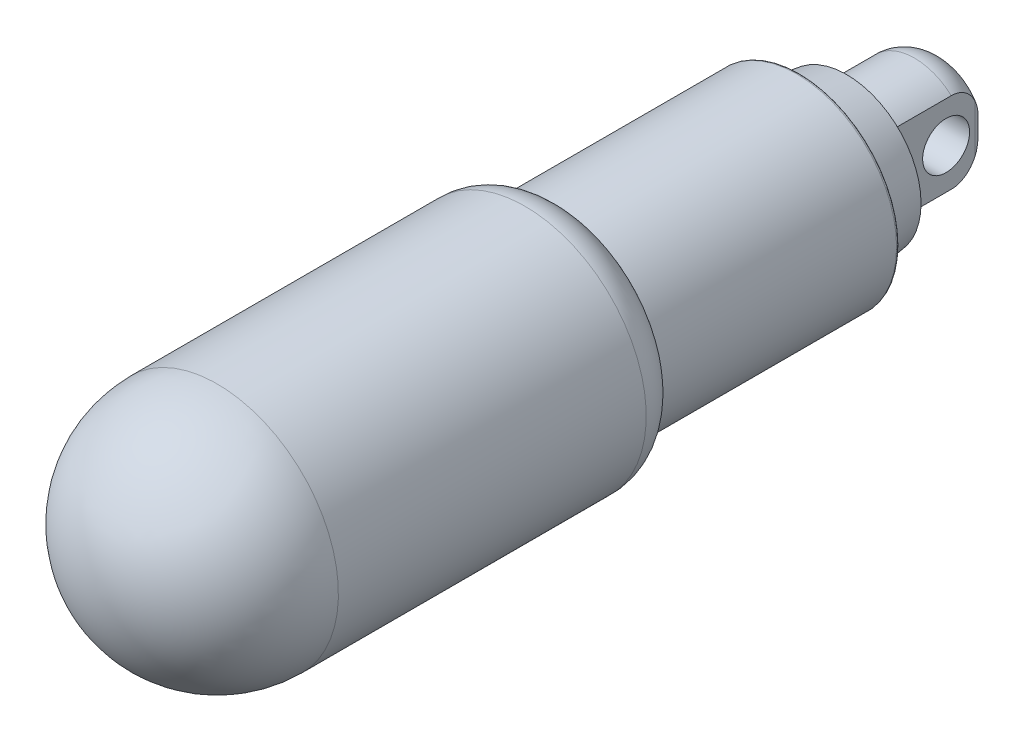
ISO-10303-21;
HEADER;
FILE_DESCRIPTION(('STEP AP214'),'2;1');
FILE_NAME('part.step','',(''),(''),'','','');
FILE_SCHEMA(('AUTOMOTIVE_DESIGN { 1 0 10303 214 1 1 1 1 }'));
ENDSEC;
DATA;
#1=APPLICATION_CONTEXT('core data for automotive mechanical design processes');
#2=APPLICATION_PROTOCOL_DEFINITION('international standard','automotive_design',2000,#1);
#3=PRODUCT_CONTEXT('',#1,'mechanical');
#4=PRODUCT('Part','Part','',(#3));
#5=PRODUCT_RELATED_PRODUCT_CATEGORY('part','',(#4));
#6=PRODUCT_DEFINITION_FORMATION('','',#4);
#7=PRODUCT_DEFINITION_CONTEXT('part definition',#1,'design');
#8=PRODUCT_DEFINITION('design','',#6,#7);
#9=PRODUCT_DEFINITION_SHAPE('','',#8);
#10=(LENGTH_UNIT() NAMED_UNIT(*) SI_UNIT(.MILLI.,.METRE.));
#11=(NAMED_UNIT(*) PLANE_ANGLE_UNIT() SI_UNIT($,.RADIAN.));
#12=(NAMED_UNIT(*) SI_UNIT($,.STERADIAN.) SOLID_ANGLE_UNIT());
#13=UNCERTAINTY_MEASURE_WITH_UNIT(LENGTH_MEASURE(1.E-05),#10,'distance_accuracy_value','');
#14=(GEOMETRIC_REPRESENTATION_CONTEXT(3) GLOBAL_UNCERTAINTY_ASSIGNED_CONTEXT((#13)) GLOBAL_UNIT_ASSIGNED_CONTEXT((#10,
#11,#12)) REPRESENTATION_CONTEXT('',''));
#15=CARTESIAN_POINT('',(0.,0.,0.));
#16=DIRECTION('',(0.,0.,1.));
#17=DIRECTION('',(1.,0.,0.));
#18=AXIS2_PLACEMENT_3D('',#15,#16,#17);
#19=CARTESIAN_POINT('',(0.,0.75,-2.3333333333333));
#20=DIRECTION('',(0.,0.,-1.));
#21=DIRECTION('',(0.,1.,0.));
#22=AXIS2_PLACEMENT_3D('',#19,#20,#21);
#23=PLANE('',#22);
#24=CARTESIAN_POINT('',(0.,0.,-2.3333333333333));
#25=DIRECTION('',(0.,0.,1.));
#26=DIRECTION('',(1.,0.,0.));
#27=AXIS2_PLACEMENT_3D('',#24,#25,#26);
#28=CIRCLE('',#27,1.5);
#29=CARTESIAN_POINT('',(1.5,0.,-2.3333333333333));
#30=VERTEX_POINT('',#29);
#31=CARTESIAN_POINT('',(0.,1.5,-2.3333333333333));
#32=VERTEX_POINT('',#31);
#33=EDGE_CURVE('E186',#30,#32,#28,.T.);
#34=ORIENTED_EDGE('',*,*,#33,.F.);
#35=CARTESIAN_POINT('',(0.,0.,-2.3333333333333));
#36=DIRECTION('',(0.,0.,1.));
#37=DIRECTION('',(-1.,0.,0.));
#38=AXIS2_PLACEMENT_3D('',#35,#36,#37);
#39=CIRCLE('',#38,1.5);
#40=CARTESIAN_POINT('',(-1.5,0.,-2.3333333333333));
#41=VERTEX_POINT('',#40);
#42=EDGE_CURVE('E81',#41,#30,#39,.T.);
#43=ORIENTED_EDGE('',*,*,#42,.F.);
#44=CARTESIAN_POINT('',(0.,0.,-2.3333333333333));
#45=DIRECTION('',(0.,0.,1.));
#46=DIRECTION('',(0.,1.,0.));
#47=AXIS2_PLACEMENT_3D('',#44,#45,#46);
#48=CIRCLE('',#47,1.49999999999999);
#49=EDGE_CURVE('E182',#32,#41,#48,.T.);
#50=ORIENTED_EDGE('',*,*,#49,.F.);
#51=EDGE_LOOP('',(#34,#43,#50));
#52=FACE_BOUND('',#51,.T.);
#53=ADVANCED_FACE('F14',(#52),#23,.T.);
#54=CARTESIAN_POINT('',(-1.85,-7.75,-1.8333333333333));
#55=DIRECTION('',(0.,-1.,0.));
#56=DIRECTION('',(1.,0.,0.));
#57=AXIS2_PLACEMENT_3D('',#54,#55,#56);
#58=CYLINDRICAL_SURFACE('',#57,0.5);
#59=DIRECTION('',(0.,1.,0.));
#60=VECTOR('',#59,1.);
#61=CARTESIAN_POINT('',(-2.35,-7.75,-1.8333333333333));
#62=LINE('',#61,#60);
#63=CARTESIAN_POINT('',(-2.35,-1.5640098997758,-1.8333333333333));
#64=VERTEX_POINT('',#63);
#65=CARTESIAN_POINT('',(-2.35,1.56400989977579,-1.8333333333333));
#66=VERTEX_POINT('',#65);
#67=EDGE_CURVE('E112',#64,#66,#62,.T.);
#68=ORIENTED_EDGE('',*,*,#67,.T.);
#69=CARTESIAN_POINT('',(-2.35,-1.5640098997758,-1.8333333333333));
#70=CARTESIAN_POINT('',(-2.35000059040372,-1.52921617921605,-1.85033683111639));
#71=CARTESIAN_POINT('',(-2.34913273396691,-1.49426464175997,-1.86699499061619));
#72=CARTESIAN_POINT('',(-2.3458742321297,-1.42405953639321,-1.89947718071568));
#73=CARTESIAN_POINT('',(-2.34348409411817,-1.38880607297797,-1.91530148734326));
#74=CARTESIAN_POINT('',(-2.33436002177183,-1.28269217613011,-1.96127595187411));
#75=CARTESIAN_POINT('',(-2.32567104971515,-1.21136632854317,-1.98998321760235));
#76=CARTESIAN_POINT('',(-2.30491634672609,-1.06739492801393,-2.04275325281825));
#77=CARTESIAN_POINT('',(-2.29284515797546,-0.994747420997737,-2.06680840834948));
#78=CARTESIAN_POINT('',(-2.26741048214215,-0.848150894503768,-2.10972121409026));
#79=CARTESIAN_POINT('',(-2.25404704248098,-0.774201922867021,-2.1285790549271));
#80=CARTESIAN_POINT('',(-2.23371793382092,-0.656205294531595,-2.15412271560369));
#81=CARTESIAN_POINT('',(-2.22641554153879,-0.612597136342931,-2.16259953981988));
#82=CARTESIAN_POINT('',(-2.21262642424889,-0.524936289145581,-2.17772651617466));
#83=CARTESIAN_POINT('',(-2.20613963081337,-0.480883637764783,-2.18437682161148));
#84=CARTESIAN_POINT('',(-2.1944499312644,-0.39247721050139,-2.1958543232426));
#85=CARTESIAN_POINT('',(-2.18924403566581,-0.34812438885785,-2.20068577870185));
#86=CARTESIAN_POINT('',(-2.18049591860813,-0.259099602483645,-2.2085766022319));
#87=CARTESIAN_POINT('',(-2.1769534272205,-0.21442769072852,-2.21163625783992));
#88=CARTESIAN_POINT('',(-2.17276895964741,-0.141431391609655,-2.21520313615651));
#89=CARTESIAN_POINT('',(-2.17153891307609,-0.113164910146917,-2.21623573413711));
#90=CARTESIAN_POINT('',(-2.16989218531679,-0.0566002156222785,-2.21761158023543));
#91=CARTESIAN_POINT('',(-2.16947528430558,-0.0283020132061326,-2.2179550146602));
#92=CARTESIAN_POINT('',(-2.16948364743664,0.0682596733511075,-2.21795563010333));
#93=CARTESIAN_POINT('',(-2.17192890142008,0.136541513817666,-2.2159593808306));
#94=CARTESIAN_POINT('',(-2.1812385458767,0.272585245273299,-2.20792078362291));
#95=CARTESIAN_POINT('',(-2.18810618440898,0.340346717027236,-2.20187546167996));
#96=CARTESIAN_POINT('',(-2.20504645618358,0.475336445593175,-2.18558202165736));
#97=CARTESIAN_POINT('',(-2.21513705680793,0.542559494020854,-2.17531024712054));
#98=CARTESIAN_POINT('',(-2.23687971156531,0.675941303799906,-2.15050039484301));
#99=CARTESIAN_POINT('',(-2.24853171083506,0.742100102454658,-2.1359624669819));
#100=CARTESIAN_POINT('',(-2.27165531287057,0.872912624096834,-2.10279970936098));
#101=CARTESIAN_POINT('',(-2.28312760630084,0.937573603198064,-2.08420392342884));
#102=CARTESIAN_POINT('',(-2.30445804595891,1.06589445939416,-2.04310545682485));
#103=CARTESIAN_POINT('',(-2.31431668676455,1.12955463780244,-2.02060397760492));
#104=CARTESIAN_POINT('',(-2.3309893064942,1.25551542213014,-1.97224765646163));
#105=CARTESIAN_POINT('',(-2.33782319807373,1.31782227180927,-1.94641623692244));
#106=CARTESIAN_POINT('',(-2.34733950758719,1.44158364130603,-1.89187345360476));
#107=CARTESIAN_POINT('',(-2.35001595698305,1.50303681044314,-1.86315801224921));
#108=CARTESIAN_POINT('',(-2.35,1.56400989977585,-1.8333333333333));
#109=B_SPLINE_CURVE_WITH_KNOTS('',3,(#69,#70,#71,#72,#73,#74,#75,#76,#77,#78,#79,#80,#81,#82,
#83,#84,#85,#86,#87,#88,#89,#90,#91,#92,#93,#94,#95,#96,#97,#98,#99,#100,#101,#102,#103,#104,
#105,#106,#107,#108),.UNSPECIFIED.,.F.,.F.,(4,2,2,2,2,2,2,2,2,2,2,2,2,2,2,2,2,2,2,4),(0.,
0.116151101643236,0.232263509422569,0.464114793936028,0.696342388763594,0.928561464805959,
1.06358517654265,1.19859755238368,1.33329176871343,1.46796412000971,1.55288110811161,
1.63777513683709,1.84252518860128,2.04742579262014,2.25348922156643,2.45954541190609,
2.66417250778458,2.8687367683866,3.0719335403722,3.27542175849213),.UNSPECIFIED.);
#110=EDGE_CURVE('E80',#64,#66,#109,.T.);
#111=ORIENTED_EDGE('',*,*,#110,.F.);
#112=EDGE_LOOP('',(#68,#111));
#113=FACE_BOUND('',#112,.T.);
#114=ADVANCED_FACE('F227',(#113),#58,.T.);
#115=CARTESIAN_POINT('',(7.75,0.,0.));
#116=DIRECTION('',(1.,0.,0.));
#117=DIRECTION('',(0.,1.,0.));
#118=AXIS2_PLACEMENT_3D('',#115,#116,#117);
#119=CYLINDRICAL_SURFACE('',#118,1.5);
#120=CARTESIAN_POINT('',(2.35,0.,0.));
#121=DIRECTION('',(1.,0.,0.));
#122=DIRECTION('',(0.,1.,0.));
#123=AXIS2_PLACEMENT_3D('',#120,#121,#122);
#124=CIRCLE('',#123,1.5);
#125=CARTESIAN_POINT('',(2.35,1.5,0.));
#126=VERTEX_POINT('',#125);
#127=EDGE_CURVE('E92',#126,#126,#124,.T.);
#128=ORIENTED_EDGE('',*,*,#127,.T.);
#129=EDGE_LOOP('',(#128));
#130=FACE_BOUND('',#129,.T.);
#131=CARTESIAN_POINT('',(-2.35,0.,0.));
#132=DIRECTION('',(1.,0.,0.));
#133=DIRECTION('',(0.,1.,0.));
#134=AXIS2_PLACEMENT_3D('',#131,#132,#133);
#135=CIRCLE('',#134,1.5);
#136=CARTESIAN_POINT('',(-2.35,1.5,0.));
#137=VERTEX_POINT('',#136);
#138=EDGE_CURVE('E218',#137,#137,#135,.F.);
#139=ORIENTED_EDGE('',*,*,#138,.T.);
#140=EDGE_LOOP('',(#139));
#141=FACE_BOUND('',#140,.T.);
#142=ADVANCED_FACE('F241',(#130,#141),#119,.F.);
#143=CARTESIAN_POINT('',(1.85,-7.75,-1.8333333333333));
#144=DIRECTION('',(0.,-1.,0.));
#145=DIRECTION('',(1.,0.,0.));
#146=AXIS2_PLACEMENT_3D('',#143,#144,#145);
#147=CYLINDRICAL_SURFACE('',#146,0.5);
#148=DIRECTION('',(0.,1.,0.));
#149=VECTOR('',#148,1.);
#150=CARTESIAN_POINT('',(2.35,-7.75,-1.8333333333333));
#151=LINE('',#150,#149);
#152=CARTESIAN_POINT('',(2.35,1.5640098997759,-1.8333333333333));
#153=VERTEX_POINT('',#152);
#154=CARTESIAN_POINT('',(2.35,-1.5640098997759,-1.8333333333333));
#155=VERTEX_POINT('',#154);
#156=EDGE_CURVE('E77',#153,#155,#151,.F.);
#157=ORIENTED_EDGE('',*,*,#156,.T.);
#158=CARTESIAN_POINT('',(2.35,1.5640098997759,-1.8333333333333));
#159=CARTESIAN_POINT('',(2.35000059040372,1.52921617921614,-1.85033683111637));
#160=CARTESIAN_POINT('',(2.34913273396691,1.49426464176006,-1.86699499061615));
#161=CARTESIAN_POINT('',(2.34587423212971,1.4240595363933,-1.89947718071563));
#162=CARTESIAN_POINT('',(2.34348409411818,1.38880607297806,-1.91530148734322));
#163=CARTESIAN_POINT('',(2.33436002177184,1.2826921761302,-1.96127595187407));
#164=CARTESIAN_POINT('',(2.32567104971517,1.21136632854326,-1.98998321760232));
#165=CARTESIAN_POINT('',(2.3049163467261,1.06739492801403,-2.04275325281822));
#166=CARTESIAN_POINT('',(2.29284515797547,0.994747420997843,-2.06680840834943));
#167=CARTESIAN_POINT('',(2.26741048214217,0.848150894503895,-2.10972121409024));
#168=CARTESIAN_POINT('',(2.254047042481,0.774201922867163,-2.12857905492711));
#169=CARTESIAN_POINT('',(2.23371793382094,0.656205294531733,-2.15412271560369));
#170=CARTESIAN_POINT('',(2.22641554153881,0.612597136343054,-2.16259953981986));
#171=CARTESIAN_POINT('',(2.21262642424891,0.52493628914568,-2.17772651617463));
#172=CARTESIAN_POINT('',(2.20613963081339,0.480883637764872,-2.18437682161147));
#173=CARTESIAN_POINT('',(2.19444993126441,0.392477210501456,-2.19585432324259));
#174=CARTESIAN_POINT('',(2.18924403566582,0.348124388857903,-2.20068577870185));
#175=CARTESIAN_POINT('',(2.18049591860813,0.259099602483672,-2.2085766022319));
#176=CARTESIAN_POINT('',(2.1769534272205,0.214427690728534,-2.21163625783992));
#177=CARTESIAN_POINT('',(2.17276895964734,0.141431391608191,-2.21520313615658));
#178=CARTESIAN_POINT('',(2.17153891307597,0.113164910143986,-2.21623573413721));
#179=CARTESIAN_POINT('',(2.16989218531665,0.0566002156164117,-2.21761158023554));
#180=CARTESIAN_POINT('',(2.16947528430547,0.0283020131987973,-2.21795501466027));
#181=CARTESIAN_POINT('',(2.16948364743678,-0.0682596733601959,-2.21795563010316));
#182=CARTESIAN_POINT('',(2.1719289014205,-0.136541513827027,-2.21595938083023));
#183=CARTESIAN_POINT('',(2.1812385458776,-0.272585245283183,-2.20792078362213));
#184=CARTESIAN_POINT('',(2.18810618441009,-0.34034671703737,-2.20187546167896));
#185=CARTESIAN_POINT('',(2.20504645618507,-0.475336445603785,-2.18558202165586));
#186=CARTESIAN_POINT('',(2.2151370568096,-0.54255949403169,-2.17531024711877));
#187=CARTESIAN_POINT('',(2.23687971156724,-0.675941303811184,-2.15050039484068));
#188=CARTESIAN_POINT('',(2.24853171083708,-0.742100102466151,-2.13596246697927));
#189=CARTESIAN_POINT('',(2.27165531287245,-0.872912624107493,-2.10279970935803));
#190=CARTESIAN_POINT('',(2.28312760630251,-0.937573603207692,-2.08420392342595));
#191=CARTESIAN_POINT('',(2.30445804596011,-1.06589445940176,-2.04310545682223));
#192=CARTESIAN_POINT('',(2.31431668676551,-1.12955463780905,-2.02060397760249));
#193=CARTESIAN_POINT('',(2.33098930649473,-1.25551542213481,-1.97224765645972));
#194=CARTESIAN_POINT('',(2.33782319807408,-1.31782227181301,-1.94641623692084));
#195=CARTESIAN_POINT('',(2.34733950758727,-1.44158364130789,-1.89187345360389));
#196=CARTESIAN_POINT('',(2.35001595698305,-1.50303681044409,-1.86315801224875));
#197=CARTESIAN_POINT('',(2.35,-1.5640098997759,-1.8333333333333));
#198=B_SPLINE_CURVE_WITH_KNOTS('',3,(#158,#159,#160,#161,#162,#163,#164,#165,#166,#167,#168,
#169,#170,#171,#172,#173,#174,#175,#176,#177,#178,#179,#180,#181,#182,#183,#184,#185,#186,#187,
#188,#189,#190,#191,#192,#193,#194,#195,#196,#197),.UNSPECIFIED.,.F.,.F.,(4,2,2,2,2,2,2,2,2,2,2,
2,2,2,2,2,2,2,2,4),(0.,0.11615110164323,0.232263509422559,0.464114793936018,0.696342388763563,
0.928561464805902,1.06358517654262,1.19859755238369,1.33329176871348,1.46796412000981,
1.5528811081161,1.63777513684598,1.84252518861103,2.04742579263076,2.25348922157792,
2.45954541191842,2.66417250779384,2.86873676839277,3.07193354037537,3.27542175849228),.UNSPECIFIED.);
#199=EDGE_CURVE('E73',#153,#155,#198,.T.);
#200=ORIENTED_EDGE('',*,*,#199,.F.);
#201=EDGE_LOOP('',(#157,#200));
#202=FACE_BOUND('',#201,.T.);
#203=ADVANCED_FACE('F75',(#202),#147,.T.);
#204=CARTESIAN_POINT('',(-1.5,0.,-0.3333333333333));
#205=DIRECTION('',(0.,-1.,0.));
#206=DIRECTION('',(-1.,0.,0.));
#207=AXIS2_PLACEMENT_3D('',#204,#205,#206);
#208=CIRCLE('',#207,2.);
#209=TRIMMED_CURVE('',#208,(PARAMETER_VALUE(-2.41885840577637)),
(PARAMETER_VALUE(2.41885840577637)),.T.,.PARAMETER.);
#210=CARTESIAN_POINT('',(0.,0.,-0.3333333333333));
#211=DIRECTION('',(0.,0.,1.));
#212=AXIS1_PLACEMENT('',#210,#211);
#213=SURFACE_OF_REVOLUTION('',#209,#212);
#214=ORIENTED_EDGE('',*,*,#49,.T.);
#215=ORIENTED_EDGE('',*,*,#42,.T.);
#216=ORIENTED_EDGE('',*,*,#33,.T.);
#217=EDGE_LOOP('',(#214,#215,#216));
#218=FACE_BOUND('',#217,.T.);
#219=CARTESIAN_POINT('',(-2.35,-2.5937424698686,-0.3333333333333));
#220=CARTESIAN_POINT('',(-2.35,-2.59375045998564,-0.377182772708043));
#221=CARTESIAN_POINT('',(-2.35,-2.59179672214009,-0.421028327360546));
#222=CARTESIAN_POINT('',(-2.35,-2.58402697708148,-0.508363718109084));
#223=CARTESIAN_POINT('',(-2.35,-2.57821207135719,-0.551853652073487));
#224=CARTESIAN_POINT('',(-2.35,-2.56281070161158,-0.637989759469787));
#225=CARTESIAN_POINT('',(-2.35,-2.55323878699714,-0.680638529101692));
#226=CARTESIAN_POINT('',(-2.35,-2.53044831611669,-0.764938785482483));
#227=CARTESIAN_POINT('',(-2.35,-2.51722965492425,-0.806590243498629));
#228=CARTESIAN_POINT('',(-2.35,-2.47233422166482,-0.929550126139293));
#229=CARTESIAN_POINT('',(-2.35,-2.43539328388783,-1.00899955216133));
#230=CARTESIAN_POINT('',(-2.35,-2.34912359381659,-1.16079487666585));
#231=CARTESIAN_POINT('',(-2.35,-2.2997896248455,-1.2331377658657));
#232=CARTESIAN_POINT('',(-2.35,-2.18890735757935,-1.3716343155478));
#233=CARTESIAN_POINT('',(-2.35,-2.12701431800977,-1.43751055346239));
#234=CARTESIAN_POINT('',(-2.35,-1.99429539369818,-1.55958499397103));
#235=CARTESIAN_POINT('',(-2.35,-1.92346279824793,-1.61577585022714));
#236=CARTESIAN_POINT('',(-2.35,-1.80388642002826,-1.69841652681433));
#237=CARTESIAN_POINT('',(-2.35,-1.75722498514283,-1.72795114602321));
#238=CARTESIAN_POINT('',(-2.35,-1.66198564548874,-1.78333397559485));
#239=CARTESIAN_POINT('',(-2.35,-1.6134153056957,-1.80919516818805));
#240=CARTESIAN_POINT('',(-2.35,-1.5640098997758,-1.8333333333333));
#241=B_SPLINE_CURVE_WITH_KNOTS('',3,(#219,#220,#221,#222,#223,#224,#225,#226,#227,#228,#229,
#230,#231,#232,#233,#234,#235,#236,#237,#238,#239,#240),.UNSPECIFIED.,.F.,.F.,(4,2,2,2,2,2,2,2,
2,2,4),(0.,0.131498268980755,0.262959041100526,0.393915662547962,0.524876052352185,
0.786389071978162,1.04801235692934,1.3181350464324,1.58846173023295,1.75398900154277,
1.91891589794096),.UNSPECIFIED.);
#242=CARTESIAN_POINT('',(-2.35,-2.5937424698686,-0.3333333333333));
#243=VERTEX_POINT('',#242);
#244=EDGE_CURVE('E115',#243,#64,#241,.T.);
#245=ORIENTED_EDGE('',*,*,#244,.T.);
#246=ORIENTED_EDGE('',*,*,#110,.T.);
#247=CARTESIAN_POINT('',(-2.35,1.56400989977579,-1.8333333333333));
#248=CARTESIAN_POINT('',(-2.34999999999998,1.61224710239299,-1.80976387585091));
#249=CARTESIAN_POINT('',(-2.34999999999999,1.65968111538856,-1.78455890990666));
#250=CARTESIAN_POINT('',(-2.35000000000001,1.75263202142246,-1.73072923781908));
#251=CARTESIAN_POINT('',(-2.35000000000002,1.798146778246,-1.70210085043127));
#252=CARTESIAN_POINT('',(-2.34999999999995,1.93182221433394,-1.61050564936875));
#253=CARTESIAN_POINT('',(-2.34999999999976,2.01641491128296,-1.5421614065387));
#254=CARTESIAN_POINT('',(-2.34999999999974,2.17273088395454,-1.39094225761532));
#255=CARTESIAN_POINT('',(-2.34999999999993,2.24436939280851,-1.30797819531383));
#256=CARTESIAN_POINT('',(-2.35000000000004,2.33849905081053,-1.17446663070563));
#257=CARTESIAN_POINT('',(-2.35000000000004,2.36762858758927,-1.12850944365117));
#258=CARTESIAN_POINT('',(-2.34999999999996,2.42107941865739,-1.03388898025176));
#259=CARTESIAN_POINT('',(-2.34999999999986,2.44540234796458,-0.985226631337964));
#260=CARTESIAN_POINT('',(-2.3499999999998,2.5009965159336,-0.857696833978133));
#261=CARTESIAN_POINT('',(-2.34999999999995,2.52853747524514,-0.777167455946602));
#262=CARTESIAN_POINT('',(-2.35000000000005,2.56964585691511,-0.612693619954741));
#263=CARTESIAN_POINT('',(-2.35000000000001,2.58323615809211,-0.528754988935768));
#264=CARTESIAN_POINT('',(-2.35,2.59096626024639,-0.425906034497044));
#265=CARTESIAN_POINT('',(-2.35,2.59200773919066,-0.407393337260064));
#266=CARTESIAN_POINT('',(-2.35,2.59339486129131,-0.370366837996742));
#267=CARTESIAN_POINT('',(-2.35,2.59374143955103,-0.351853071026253));
#268=CARTESIAN_POINT('',(-2.35,2.59374246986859,-0.3333333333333));
#269=B_SPLINE_CURVE_WITH_KNOTS('',3,(#247,#248,#249,#250,#251,#252,#253,#254,#255,#256,#257,
#258,#259,#260,#261,#262,#263,#264,#265,#266,#267,#268),.UNSPECIFIED.,.F.,.F.,(4,2,2,2,2,2,2,2,
2,2,4),(0.,0.161012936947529,0.32220059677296,0.646874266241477,0.973601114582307,
1.1365930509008,1.29952944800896,1.55365932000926,1.80737175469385,1.86299068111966,
1.91853471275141),.UNSPECIFIED.);
#270=CARTESIAN_POINT('',(-2.35,2.59374246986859,-0.3333333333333));
#271=VERTEX_POINT('',#270);
#272=EDGE_CURVE('E111',#66,#271,#269,.T.);
#273=ORIENTED_EDGE('',*,*,#272,.T.);
#274=CARTESIAN_POINT('',(0.,0.,-0.3333333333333));
#275=DIRECTION('',(0.,0.,-1.));
#276=DIRECTION('',(-1.,0.,0.));
#277=AXIS2_PLACEMENT_3D('',#274,#275,#276);
#278=CIRCLE('',#277,3.5);
#279=CARTESIAN_POINT('',(2.35,2.59374246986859,-0.3333333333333));
#280=VERTEX_POINT('',#279);
#281=EDGE_CURVE('E88',#280,#271,#278,.F.);
#282=ORIENTED_EDGE('',*,*,#281,.F.);
#283=CARTESIAN_POINT('',(2.35,2.59374246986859,-0.3333333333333));
#284=CARTESIAN_POINT('',(2.35,2.59375045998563,-0.377182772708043));
#285=CARTESIAN_POINT('',(2.35,2.59179672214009,-0.421028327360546));
#286=CARTESIAN_POINT('',(2.35,2.58402697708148,-0.508363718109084));
#287=CARTESIAN_POINT('',(2.35,2.57821207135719,-0.551853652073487));
#288=CARTESIAN_POINT('',(2.35,2.56281070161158,-0.637989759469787));
#289=CARTESIAN_POINT('',(2.35,2.55323878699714,-0.680638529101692));
#290=CARTESIAN_POINT('',(2.35,2.53044831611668,-0.764938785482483));
#291=CARTESIAN_POINT('',(2.35,2.51722965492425,-0.806590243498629));
#292=CARTESIAN_POINT('',(2.35,2.47233422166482,-0.929550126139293));
#293=CARTESIAN_POINT('',(2.35,2.43539328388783,-1.00899955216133));
#294=CARTESIAN_POINT('',(2.35,2.34912359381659,-1.16079487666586));
#295=CARTESIAN_POINT('',(2.35,2.29978962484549,-1.2331377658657));
#296=CARTESIAN_POINT('',(2.35,2.18890735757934,-1.3716343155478));
#297=CARTESIAN_POINT('',(2.35,2.12701431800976,-1.43751055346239));
#298=CARTESIAN_POINT('',(2.35,1.99429539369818,-1.55958499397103));
#299=CARTESIAN_POINT('',(2.35,1.92346279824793,-1.61577585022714));
#300=CARTESIAN_POINT('',(2.35,1.80388642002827,-1.69841652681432));
#301=CARTESIAN_POINT('',(2.35,1.75722498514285,-1.72795114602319));
#302=CARTESIAN_POINT('',(2.35,1.66198564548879,-1.78333397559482));
#303=CARTESIAN_POINT('',(2.35,1.61341530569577,-1.80919516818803));
#304=CARTESIAN_POINT('',(2.35,1.5640098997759,-1.8333333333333));
#305=B_SPLINE_CURVE_WITH_KNOTS('',3,(#283,#284,#285,#286,#287,#288,#289,#290,#291,#292,#293,
#294,#295,#296,#297,#298,#299,#300,#301,#302,#303,#304),.UNSPECIFIED.,.F.,.F.,(4,2,2,2,2,2,2,2,
2,2,4),(0.,0.131498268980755,0.262959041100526,0.393915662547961,0.524876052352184,
0.786389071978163,1.04801235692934,1.3181350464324,1.58846173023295,1.75398900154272,
1.91891589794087),.UNSPECIFIED.);
#306=EDGE_CURVE('E84',#280,#153,#305,.T.);
#307=ORIENTED_EDGE('',*,*,#306,.T.);
#308=ORIENTED_EDGE('',*,*,#199,.T.);
#309=CARTESIAN_POINT('',(2.35,-1.5640098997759,-1.8333333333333));
#310=CARTESIAN_POINT('',(2.34999999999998,-1.61224710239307,-1.80976387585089));
#311=CARTESIAN_POINT('',(2.34999999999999,-1.65968111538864,-1.78455890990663));
#312=CARTESIAN_POINT('',(2.35000000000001,-1.75263202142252,-1.73072923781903));
#313=CARTESIAN_POINT('',(2.35000000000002,-1.79814677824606,-1.70210085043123));
#314=CARTESIAN_POINT('',(2.34999999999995,-1.93182221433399,-1.61050564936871));
#315=CARTESIAN_POINT('',(2.34999999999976,-2.01641491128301,-1.54216140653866));
#316=CARTESIAN_POINT('',(2.34999999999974,-2.17273088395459,-1.39094225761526));
#317=CARTESIAN_POINT('',(2.34999999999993,-2.24436939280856,-1.30797819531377));
#318=CARTESIAN_POINT('',(2.35000000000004,-2.33849905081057,-1.17446663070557));
#319=CARTESIAN_POINT('',(2.35000000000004,-2.3676285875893,-1.1285094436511));
#320=CARTESIAN_POINT('',(2.34999999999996,-2.42107941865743,-1.0338889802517));
#321=CARTESIAN_POINT('',(2.34999999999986,-2.44540234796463,-0.98522663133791));
#322=CARTESIAN_POINT('',(2.34999999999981,-2.50099651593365,-0.857696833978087));
#323=CARTESIAN_POINT('',(2.34999999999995,-2.52853747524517,-0.77716745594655));
#324=CARTESIAN_POINT('',(2.35000000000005,-2.56964585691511,-0.612693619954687));
#325=CARTESIAN_POINT('',(2.35,-2.58323615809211,-0.528754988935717));
#326=CARTESIAN_POINT('',(2.35,-2.59096626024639,-0.425906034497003));
#327=CARTESIAN_POINT('',(2.35,-2.59200773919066,-0.407393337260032));
#328=CARTESIAN_POINT('',(2.35,-2.59339486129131,-0.370366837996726));
#329=CARTESIAN_POINT('',(2.35,-2.59374143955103,-0.351853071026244));
#330=CARTESIAN_POINT('',(2.35,-2.5937424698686,-0.3333333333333));
#331=B_SPLINE_CURVE_WITH_KNOTS('',3,(#309,#310,#311,#312,#313,#314,#315,#316,#317,#318,#319,
#320,#321,#322,#323,#324,#325,#326,#327,#328,#329,#330),.UNSPECIFIED.,.F.,.F.,(4,2,2,2,2,2,2,2,
2,2,4),(0.,0.161012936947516,0.322200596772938,0.646874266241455,0.97360111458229,
1.13659305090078,1.29952944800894,1.55365932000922,1.80737175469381,1.8629906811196,
1.91853471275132),.UNSPECIFIED.);
#332=CARTESIAN_POINT('',(2.35,-2.5937424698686,-0.3333333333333));
#333=VERTEX_POINT('',#332);
#334=EDGE_CURVE('E98',#155,#333,#331,.T.);
#335=ORIENTED_EDGE('',*,*,#334,.T.);
#336=CARTESIAN_POINT('',(0.,0.,-0.3333333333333));
#337=DIRECTION('',(0.,0.,-1.));
#338=DIRECTION('',(-1.,0.,0.));
#339=AXIS2_PLACEMENT_3D('',#336,#337,#338);
#340=CIRCLE('',#339,3.5);
#341=EDGE_CURVE('E108',#243,#333,#340,.F.);
#342=ORIENTED_EDGE('',*,*,#341,.F.);
#343=EDGE_LOOP('',(#245,#246,#273,#282,#307,#308,#335,#342));
#344=FACE_BOUND('',#343,.T.);
#345=ADVANCED_FACE('F86',(#218,#344),#213,.F.);
#346=CARTESIAN_POINT('',(0.,0.,1.8333333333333));
#347=DIRECTION('',(0.,0.,-1.));
#348=DIRECTION('',(-1.,0.,0.));
#349=AXIS2_PLACEMENT_3D('',#346,#347,#348);
#350=CYLINDRICAL_SURFACE('',#349,3.5);
#351=DIRECTION('',(0.,0.,-1.));
#352=VECTOR('',#351,1.);
#353=CARTESIAN_POINT('',(-2.35,2.59374246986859,-1.8333333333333));
#354=LINE('',#353,#352);
#355=CARTESIAN_POINT('',(-2.35,2.59374246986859,4.));
#356=VERTEX_POINT('',#355);
#357=EDGE_CURVE('E109',#271,#356,#354,.F.);
#358=ORIENTED_EDGE('',*,*,#357,.T.);
#359=CARTESIAN_POINT('',(0.,0.,4.));
#360=DIRECTION('',(0.,0.,-1.));
#361=DIRECTION('',(-1.,0.,0.));
#362=AXIS2_PLACEMENT_3D('',#359,#360,#361);
#363=CIRCLE('',#362,3.5);
#364=CARTESIAN_POINT('',(2.35,2.59374246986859,4.));
#365=VERTEX_POINT('',#364);
#366=EDGE_CURVE('E374',#365,#356,#363,.F.);
#367=ORIENTED_EDGE('',*,*,#366,.F.);
#368=DIRECTION('',(0.,0.,1.));
#369=VECTOR('',#368,1.);
#370=CARTESIAN_POINT('',(2.35,2.59374246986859,4.));
#371=LINE('',#370,#369);
#372=EDGE_CURVE('E376',#365,#280,#371,.F.);
#373=ORIENTED_EDGE('',*,*,#372,.T.);
#374=ORIENTED_EDGE('',*,*,#281,.T.);
#375=EDGE_LOOP('',(#358,#367,#373,#374));
#376=FACE_BOUND('',#375,.T.);
#377=ADVANCED_FACE('F128',(#376),#350,.T.);
#378=CARTESIAN_POINT('',(-2.35,-7.75,-1.8333333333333));
#379=DIRECTION('',(1.,0.,0.));
#380=DIRECTION('',(0.,0.,-1.));
#381=AXIS2_PLACEMENT_3D('',#378,#379,#380);
#382=PLANE('',#381);
#383=ORIENTED_EDGE('',*,*,#272,.F.);
#384=ORIENTED_EDGE('',*,*,#67,.F.);
#385=ORIENTED_EDGE('',*,*,#244,.F.);
#386=DIRECTION('',(0.,0.,-1.));
#387=VECTOR('',#386,1.);
#388=CARTESIAN_POINT('',(-2.35,-2.5937424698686,1.8333333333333));
#389=LINE('',#388,#387);
#390=CARTESIAN_POINT('',(-2.35,-2.5937424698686,4.));
#391=VERTEX_POINT('',#390);
#392=EDGE_CURVE('E105',#391,#243,#389,.T.);
#393=ORIENTED_EDGE('',*,*,#392,.F.);
#394=DIRECTION('',(0.,1.,0.));
#395=VECTOR('',#394,1.);
#396=CARTESIAN_POINT('',(-2.35,4.125,4.));
#397=LINE('',#396,#395);
#398=EDGE_CURVE('E373',#356,#391,#397,.F.);
#399=ORIENTED_EDGE('',*,*,#398,.F.);
#400=ORIENTED_EDGE('',*,*,#357,.F.);
#401=EDGE_LOOP('',(#383,#384,#385,#393,#399,#400));
#402=FACE_BOUND('',#401,.T.);
#403=ORIENTED_EDGE('',*,*,#138,.F.);
#404=EDGE_LOOP('',(#403));
#405=FACE_BOUND('',#404,.T.);
#406=ADVANCED_FACE('F229',(#402,#405),#382,.F.);
#407=CARTESIAN_POINT('',(0.,0.,1.8333333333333));
#408=DIRECTION('',(0.,0.,-1.));
#409=DIRECTION('',(-1.,0.,0.));
#410=AXIS2_PLACEMENT_3D('',#407,#408,#409);
#411=CYLINDRICAL_SURFACE('',#410,3.5);
#412=DIRECTION('',(0.,0.,1.));
#413=VECTOR('',#412,1.);
#414=CARTESIAN_POINT('',(2.35,-2.5937424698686,4.));
#415=LINE('',#414,#413);
#416=CARTESIAN_POINT('',(2.35,-2.5937424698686,4.));
#417=VERTEX_POINT('',#416);
#418=EDGE_CURVE('E100',#333,#417,#415,.T.);
#419=ORIENTED_EDGE('',*,*,#418,.T.);
#420=CARTESIAN_POINT('',(0.,0.,4.));
#421=DIRECTION('',(0.,0.,-1.));
#422=DIRECTION('',(-1.,0.,0.));
#423=AXIS2_PLACEMENT_3D('',#420,#421,#422);
#424=CIRCLE('',#423,3.5);
#425=EDGE_CURVE('E371',#391,#417,#424,.F.);
#426=ORIENTED_EDGE('',*,*,#425,.F.);
#427=ORIENTED_EDGE('',*,*,#392,.T.);
#428=ORIENTED_EDGE('',*,*,#341,.T.);
#429=EDGE_LOOP('',(#419,#426,#427,#428));
#430=FACE_BOUND('',#429,.T.);
#431=ADVANCED_FACE('F251',(#430),#411,.T.);
#432=CARTESIAN_POINT('',(2.35,-7.75,4.));
#433=DIRECTION('',(-1.,0.,0.));
#434=DIRECTION('',(0.,0.,1.));
#435=AXIS2_PLACEMENT_3D('',#432,#433,#434);
#436=PLANE('',#435);
#437=DIRECTION('',(0.,1.,0.));
#438=VECTOR('',#437,1.);
#439=CARTESIAN_POINT('',(2.35,4.125,4.));
#440=LINE('',#439,#438);
#441=EDGE_CURVE('E368',#417,#365,#440,.T.);
#442=ORIENTED_EDGE('',*,*,#441,.F.);
#443=ORIENTED_EDGE('',*,*,#418,.F.);
#444=ORIENTED_EDGE('',*,*,#334,.F.);
#445=ORIENTED_EDGE('',*,*,#156,.F.);
#446=ORIENTED_EDGE('',*,*,#306,.F.);
#447=ORIENTED_EDGE('',*,*,#372,.F.);
#448=EDGE_LOOP('',(#442,#443,#444,#445,#446,#447));
#449=FACE_BOUND('',#448,.T.);
#450=ORIENTED_EDGE('',*,*,#127,.F.);
#451=EDGE_LOOP('',(#450));
#452=FACE_BOUND('',#451,.T.);
#453=ADVANCED_FACE('F95',(#449,#452),#436,.F.);
#454=CARTESIAN_POINT('',(0.,4.125,4.));
#455=DIRECTION('',(0.,0.,-1.));
#456=DIRECTION('',(-1.,0.,0.));
#457=AXIS2_PLACEMENT_3D('',#454,#455,#456);
#458=PLANE('',#457);
#459=CARTESIAN_POINT('',(0.,0.,4.00000000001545));
#460=DIRECTION('',(0.,0.,1.));
#461=DIRECTION('',(1.,0.,0.));
#462=AXIS2_PLACEMENT_3D('',#459,#460,#461);
#463=CIRCLE('',#462,4.74999999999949);
#464=CARTESIAN_POINT('',(4.74999999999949,0.,4.00000000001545));
#465=VERTEX_POINT('',#464);
#466=EDGE_CURVE('E364',#465,#465,#463,.T.);
#467=ORIENTED_EDGE('',*,*,#466,.F.);
#468=EDGE_LOOP('',(#467));
#469=FACE_BOUND('',#468,.T.);
#470=ORIENTED_EDGE('',*,*,#425,.T.);
#471=ORIENTED_EDGE('',*,*,#441,.T.);
#472=ORIENTED_EDGE('',*,*,#366,.T.);
#473=ORIENTED_EDGE('',*,*,#398,.T.);
#474=EDGE_LOOP('',(#470,#471,#472,#473));
#475=FACE_BOUND('',#474,.T.);
#476=ADVANCED_FACE('F250',(#469,#475),#458,.T.);
#477=CARTESIAN_POINT('',(0.,0.,6.9999999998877));
#478=DIRECTION('',(0.,0.,1.));
#479=DIRECTION('',(1.,0.,0.));
#480=AXIS2_PLACEMENT_3D('',#477,#478,#479);
#481=CONICAL_SURFACE('',#480,5.17162250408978,0.139626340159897);
#482=CARTESIAN_POINT('',(0.,0.,7.00000000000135));
#483=DIRECTION('',(0.,0.,1.));
#484=DIRECTION('',(1.,0.,0.));
#485=AXIS2_PLACEMENT_3D('',#482,#483,#484);
#486=CIRCLE('',#485,5.17162250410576);
#487=CARTESIAN_POINT('',(5.17162250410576,0.,7.00000000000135));
#488=VERTEX_POINT('',#487);
#489=EDGE_CURVE('E362',#488,#488,#486,.T.);
#490=ORIENTED_EDGE('',*,*,#489,.F.);
#491=EDGE_LOOP('',(#490));
#492=FACE_BOUND('',#491,.T.);
#493=ORIENTED_EDGE('',*,*,#466,.T.);
#494=EDGE_LOOP('',(#493));
#495=FACE_BOUND('',#494,.T.);
#496=ADVANCED_FACE('F383',(#492,#495),#481,.T.);
#497=CARTESIAN_POINT('',(0.,5.6783112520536,7.));
#498=DIRECTION('',(0.,0.,-1.));
#499=DIRECTION('',(-1.,0.,0.));
#500=AXIS2_PLACEMENT_3D('',#497,#498,#499);
#501=PLANE('',#500);
#502=ORIENTED_EDGE('',*,*,#489,.T.);
#503=EDGE_LOOP('',(#502));
#504=FACE_BOUND('',#503,.T.);
#505=CARTESIAN_POINT('',(0.,0.,7.));
#506=DIRECTION('',(0.,0.,1.));
#507=DIRECTION('',(1.,0.,0.));
#508=AXIS2_PLACEMENT_3D('',#505,#506,#507);
#509=CIRCLE('',#508,6.185);
#510=CARTESIAN_POINT('',(6.185,0.,7.));
#511=VERTEX_POINT('',#510);
#512=CARTESIAN_POINT('',(0.,6.185,7.));
#513=VERTEX_POINT('',#512);
#514=EDGE_CURVE('E334',#511,#513,#509,.T.);
#515=ORIENTED_EDGE('',*,*,#514,.F.);
#516=CARTESIAN_POINT('',(0.,0.,7.));
#517=DIRECTION('',(0.,0.,1.));
#518=DIRECTION('',(-1.,0.,0.));
#519=AXIS2_PLACEMENT_3D('',#516,#517,#518);
#520=CIRCLE('',#519,6.185);
#521=CARTESIAN_POINT('',(-6.185,0.,7.));
#522=VERTEX_POINT('',#521);
#523=EDGE_CURVE('E291',#522,#511,#520,.T.);
#524=ORIENTED_EDGE('',*,*,#523,.F.);
#525=CARTESIAN_POINT('',(0.,0.,7.));
#526=DIRECTION('',(0.,0.,1.));
#527=DIRECTION('',(0.,1.,0.));
#528=AXIS2_PLACEMENT_3D('',#525,#526,#527);
#529=CIRCLE('',#528,6.185);
#530=EDGE_CURVE('E324',#513,#522,#529,.T.);
#531=ORIENTED_EDGE('',*,*,#530,.F.);
#532=EDGE_LOOP('',(#515,#524,#531));
#533=FACE_BOUND('',#532,.T.);
#534=ADVANCED_FACE('F302',(#504,#533),#501,.T.);
#535=CARTESIAN_POINT('',(0.,0.,7.2));
#536=DIRECTION('',(0.,0.,1.));
#537=DIRECTION('',(-1.,0.,0.));
#538=AXIS2_PLACEMENT_3D('',#535,#536,#537);
#539=TOROIDAL_SURFACE('',#538,6.185,0.2);
#540=ORIENTED_EDGE('',*,*,#530,.T.);
#541=ORIENTED_EDGE('',*,*,#523,.T.);
#542=ORIENTED_EDGE('',*,*,#514,.T.);
#543=EDGE_LOOP('',(#540,#541,#542));
#544=FACE_BOUND('',#543,.T.);
#545=CARTESIAN_POINT('',(0.,0.,7.2));
#546=DIRECTION('',(0.,0.,-1.));
#547=DIRECTION('',(-1.,0.,0.));
#548=AXIS2_PLACEMENT_3D('',#545,#546,#547);
#549=CIRCLE('',#548,6.385);
#550=CARTESIAN_POINT('',(-6.385,0.,7.2));
#551=VERTEX_POINT('',#550);
#552=EDGE_CURVE('E287',#551,#551,#549,.F.);
#553=ORIENTED_EDGE('',*,*,#552,.F.);
#554=EDGE_LOOP('',(#553));
#555=FACE_BOUND('',#554,.T.);
#556=ADVANCED_FACE('F297',(#544,#555),#539,.T.);
#557=CARTESIAN_POINT('',(0.,0.,14.7500027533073));
#558=DIRECTION('',(0.,0.,-1.));
#559=DIRECTION('',(-1.,0.,0.));
#560=AXIS2_PLACEMENT_3D('',#557,#558,#559);
#561=CYLINDRICAL_SURFACE('',#560,6.385);
#562=ORIENTED_EDGE('',*,*,#552,.T.);
#563=EDGE_LOOP('',(#562));
#564=FACE_BOUND('',#563,.T.);
#565=CARTESIAN_POINT('',(0.,0.,22.3000055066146));
#566=DIRECTION('',(0.,0.,1.));
#567=DIRECTION('',(-1.,0.,0.));
#568=AXIS2_PLACEMENT_3D('',#565,#566,#567);
#569=CIRCLE('',#568,6.385);
#570=CARTESIAN_POINT('',(-6.385,0.,22.3000055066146));
#571=VERTEX_POINT('',#570);
#572=EDGE_CURVE('E283',#571,#571,#569,.T.);
#573=ORIENTED_EDGE('',*,*,#572,.F.);
#574=EDGE_LOOP('',(#573));
#575=FACE_BOUND('',#574,.T.);
#576=ADVANCED_FACE('F301',(#564,#575),#561,.T.);
#577=CARTESIAN_POINT('',(0.,0.,44.25));
#578=DIRECTION('',(0.,0.,1.));
#579=DIRECTION('',(0.,-1.,0.));
#580=AXIS2_PLACEMENT_3D('',#577,#578,#579);
#581=SPHERICAL_SURFACE('',#580,7.75);
#582=CARTESIAN_POINT('',(0.,0.,52.));
#583=VERTEX_POINT('',#582);
#584=VERTEX_LOOP('',#583);
#585=FACE_BOUND('',#584,.T.);
#586=CARTESIAN_POINT('',(0.,0.,44.25));
#587=DIRECTION('',(0.,0.,-1.));
#588=DIRECTION('',(-1.,0.,0.));
#589=AXIS2_PLACEMENT_3D('',#586,#587,#588);
#590=CIRCLE('',#589,7.75);
#591=CARTESIAN_POINT('',(-7.75,0.,44.25));
#592=VERTEX_POINT('',#591);
#593=EDGE_CURVE('E26',#592,#592,#590,.T.);
#594=ORIENTED_EDGE('',*,*,#593,.F.);
#595=EDGE_LOOP('',(#594));
#596=FACE_BOUND('',#595,.T.);
#597=ADVANCED_FACE('F270',(#585,#596),#581,.T.);
#598=CARTESIAN_POINT('',(0.,0.,24.57));
#599=DIRECTION('',(0.,0.,1.));
#600=DIRECTION('',(-1.,0.,0.));
#601=AXIS2_PLACEMENT_3D('',#598,#599,#600);
#602=TOROIDAL_SURFACE('',#601,5.18,2.57);
#603=CARTESIAN_POINT('',(0.,0.,24.57));
#604=DIRECTION('',(0.,0.,-1.));
#605=DIRECTION('',(-1.,0.,0.));
#606=AXIS2_PLACEMENT_3D('',#603,#604,#605);
#607=CIRCLE('',#606,7.75);
#608=CARTESIAN_POINT('',(-7.75,0.,24.57));
#609=VERTEX_POINT('',#608);
#610=EDGE_CURVE('E9',#609,#609,#607,.F.);
#611=ORIENTED_EDGE('',*,*,#610,.F.);
#612=EDGE_LOOP('',(#611));
#613=FACE_BOUND('',#612,.T.);
#614=ORIENTED_EDGE('',*,*,#572,.T.);
#615=EDGE_LOOP('',(#614));
#616=FACE_BOUND('',#615,.T.);
#617=ADVANCED_FACE('F263',(#613,#616),#602,.T.);
#618=CARTESIAN_POINT('',(0.,0.,34.41));
#619=DIRECTION('',(0.,0.,-1.));
#620=DIRECTION('',(-1.,0.,0.));
#621=AXIS2_PLACEMENT_3D('',#618,#619,#620);
#622=CYLINDRICAL_SURFACE('',#621,7.75);
#623=ORIENTED_EDGE('',*,*,#593,.T.);
#624=EDGE_LOOP('',(#623));
#625=FACE_BOUND('',#624,.T.);
#626=ORIENTED_EDGE('',*,*,#610,.T.);
#627=EDGE_LOOP('',(#626));
#628=FACE_BOUND('',#627,.T.);
#629=ADVANCED_FACE('F261',(#625,#628),#622,.T.);
#630=CLOSED_SHELL('',(#53,#114,#142,#203,#345,#377,#406,#431,#453,#476,#496,#534,#556,#576,#597,
#617,#629));
#631=MANIFOLD_SOLID_BREP('B1',#630);
#632=ADVANCED_BREP_SHAPE_REPRESENTATION('',(#18,#631),#14);
#633=SHAPE_DEFINITION_REPRESENTATION(#9,#632);
ENDSEC;
END-ISO-10303-21;
